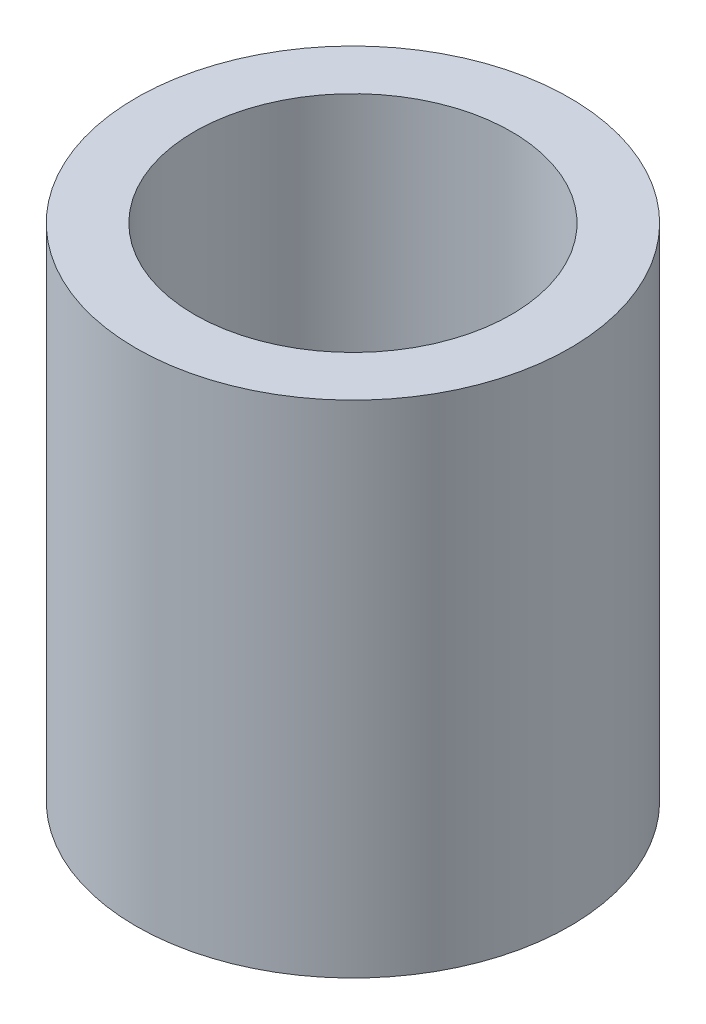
from build123d import *

# Parameters (mm, degrees)
ESQUISSE1_R      = 13
ESQUISSE1_R_2    = 9.5
EXTRUSION1_DEPTH = 30


with BuildPart() as part:
    # Esquisse1 → Extrusion1 (new body)
    with BuildSketch(Plane(origin=(0, 0, 0), x_dir=(1, 0, 0), z_dir=(0, 1, 0))):
        with Locations(Location((0, 0, 0), (0, 0, 270))):
            Circle(ESQUISSE1_R)
        with Locations(Location((0, 0, 0), (0, 0, 270))):
            Circle(ESQUISSE1_R_2, mode=Mode.SUBTRACT)
    extrude(amount=EXTRUSION1_DEPTH)


solid = part.part
